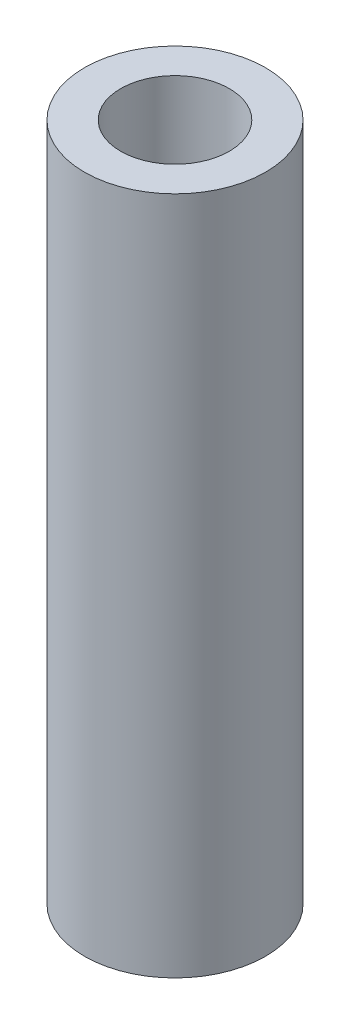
from build123d import *

# Parameters (mm, degrees)
SKETCH1_R             = 2.032
BOSS_EXTRUDE1_DEPTH   = 15.24
F_2_CLEARANCE_HOLE1_D = 2.4384


with BuildPart() as part:
    # Sketch1 → Boss-Extrude1 (new body)
    with BuildSketch(Plane(origin=(0, 0, 0), x_dir=(1, 0, 0), z_dir=(0, 1, 0))):
        with Locations(Location((0, 0, 0), (0, 0, 90))):
            Circle(SKETCH1_R)
    extrude(amount=BOSS_EXTRUDE1_DEPTH)

    # 2 Clearance Hole1 (through all)
    with Locations(Plane(origin=(0, 15.24, 0), x_dir=(1, 0, 0), z_dir=(0, 1, 0))):
        with Locations((0, 0)):
            Hole(F_2_CLEARANCE_HOLE1_D / 2)


solid = part.part
